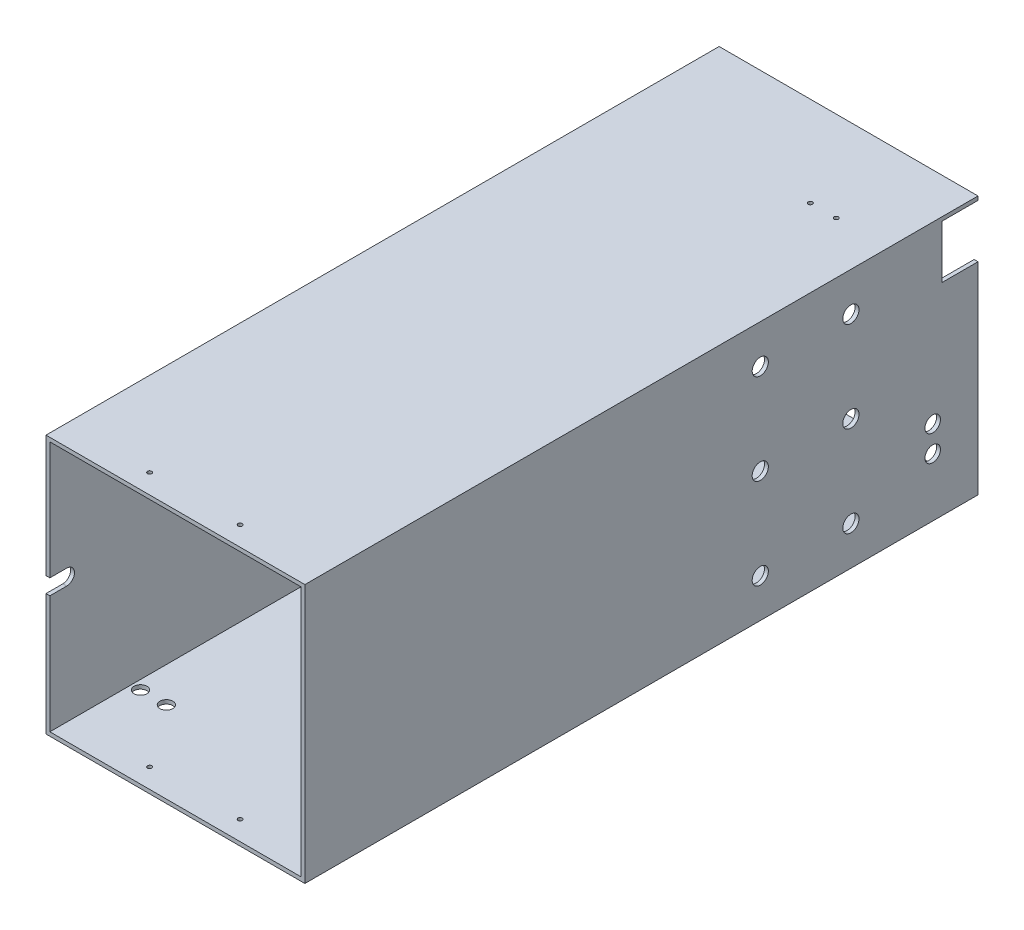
from build123d import *

# Parameters (mm, degrees)
ESQUISSE1_W                     = 200
ESQUISSE1_H                     = 200
ESQUISSE1_W_2                   = 194
ESQUISSE1_H_2                   = 194
EXTRUSION1_DEPTH                = 520
ENL_V_MAT_EXTRU_1_REACH         = 593.946
ESQUISSE2_R                     = 6
ESQUISSE2_R_2                   = 6.25
ESQUISSE2_W                     = 28
ESQUISSE2_H                     = 41
ENL_V_MAT_EXTRU_4_REACH         = 593.946
ESQUISSE7_R                     = 2.5
ENL_V_MAT_EXTRU_5_REACH         = 593.946
ESQUISSE8_R                     = 5
ESQUISSE8_R_2                   = 0.5
ESQUISSE8_W                     = 41
ESQUISSE8_H                     = 28
TROU_TARAUD_M41_D               = 3.3
TROU_TARAUD_M41_DEPTH           = 200
TROU_TARAUD_M41_ON_FACE_2_D     = 3.3
TROU_TARAUD_M41_ON_FACE_2_DEPTH = 200


with BuildPart() as part:
    # Esquisse1 → Extrusion1 (new body)
    with BuildSketch(Plane.XY):
        with Locations((100, 100)):
            Rectangle(ESQUISSE1_W, ESQUISSE1_H)
        with Locations((100, 100)):
            Rectangle(ESQUISSE1_W_2, ESQUISSE1_H_2, mode=Mode.SUBTRACT)
    extrude(amount=EXTRUSION1_DEPTH)

    # Esquisse2 → Enl_v. mat.-Extru.1 (cut, up to next)
    with BuildSketch(Plane(origin=(200, 0, 0), x_dir=(0, 0, -1), z_dir=(1, 0, 0)), mode=Mode.PRIVATE) as enl_v_mat_extru_1_sk1:
        with Locations((-35, 65)):
            Circle(ESQUISSE2_R)
    enl_v_mat_extru_1_tool1 = extrude(enl_v_mat_extru_1_sk1.sketch, amount=-ENL_V_MAT_EXTRU_1_REACH, mode=Mode.PRIVATE) & part.part
    # Esquisse2 → Enl_v. mat.-Extru.1 (cut, up to next)
    with BuildSketch(Plane(origin=(200, 0, 0), x_dir=(0, 0, -1), z_dir=(1, 0, 0)), mode=Mode.PRIVATE) as enl_v_mat_extru_1_sk2:
        with Locations((-35, 45)):
            Circle(ESQUISSE2_R)
    enl_v_mat_extru_1_tool2 = extrude(enl_v_mat_extru_1_sk2.sketch, amount=-ENL_V_MAT_EXTRU_1_REACH, mode=Mode.PRIVATE) & part.part
    # Esquisse2 → Enl_v. mat.-Extru.1 (cut, up to next)
    with BuildSketch(Plane(origin=(200, 0, 0), x_dir=(0, 0, -1), z_dir=(1, 0, 0)), mode=Mode.PRIVATE) as enl_v_mat_extru_1_sk3:
        with Locations((-98.2, 170)):
            Circle(ESQUISSE2_R_2)
    enl_v_mat_extru_1_tool3 = extrude(enl_v_mat_extru_1_sk3.sketch, amount=-ENL_V_MAT_EXTRU_1_REACH, mode=Mode.PRIVATE) & part.part
    # Esquisse2 → Enl_v. mat.-Extru.1 (cut, up to next)
    with BuildSketch(Plane(origin=(200, 0, 0), x_dir=(0, 0, -1), z_dir=(1, 0, 0)), mode=Mode.PRIVATE) as enl_v_mat_extru_1_sk4:
        with Locations((-168.2, 170)):
            Circle(ESQUISSE2_R_2)
    enl_v_mat_extru_1_tool4 = extrude(enl_v_mat_extru_1_sk4.sketch, amount=-ENL_V_MAT_EXTRU_1_REACH, mode=Mode.PRIVATE) & part.part
    # Esquisse2 → Enl_v. mat.-Extru.1 (cut, up to next)
    with BuildSketch(Plane(origin=(200, 0, 0), x_dir=(0, 0, -1), z_dir=(1, 0, 0)), mode=Mode.PRIVATE) as enl_v_mat_extru_1_sk5:
        with Locations((-98.2, 100)):
            Circle(ESQUISSE2_R_2)
    enl_v_mat_extru_1_tool5 = extrude(enl_v_mat_extru_1_sk5.sketch, amount=-ENL_V_MAT_EXTRU_1_REACH, mode=Mode.PRIVATE) & part.part
    # Esquisse2 → Enl_v. mat.-Extru.1 (cut, up to next)
    with BuildSketch(Plane(origin=(200, 0, 0), x_dir=(0, 0, -1), z_dir=(1, 0, 0)), mode=Mode.PRIVATE) as enl_v_mat_extru_1_sk6:
        with Locations((-168.2, 100)):
            Circle(ESQUISSE2_R_2)
    enl_v_mat_extru_1_tool6 = extrude(enl_v_mat_extru_1_sk6.sketch, amount=-ENL_V_MAT_EXTRU_1_REACH, mode=Mode.PRIVATE) & part.part
    # Esquisse2 → Enl_v. mat.-Extru.1 (cut, up to next)
    with BuildSketch(Plane(origin=(200, 0, 0), x_dir=(0, 0, -1), z_dir=(1, 0, 0)), mode=Mode.PRIVATE) as enl_v_mat_extru_1_sk7:
        with Locations((-98.2, 30)):
            Circle(ESQUISSE2_R_2)
    enl_v_mat_extru_1_tool7 = extrude(enl_v_mat_extru_1_sk7.sketch, amount=-ENL_V_MAT_EXTRU_1_REACH, mode=Mode.PRIVATE) & part.part
    # Esquisse2 → Enl_v. mat.-Extru.1 (cut, up to next)
    with BuildSketch(Plane(origin=(200, 0, 0), x_dir=(0, 0, -1), z_dir=(1, 0, 0)), mode=Mode.PRIVATE) as enl_v_mat_extru_1_sk8:
        with Locations((-168.2, 30)):
            Circle(ESQUISSE2_R_2)
    enl_v_mat_extru_1_tool8 = extrude(enl_v_mat_extru_1_sk8.sketch, amount=-ENL_V_MAT_EXTRU_1_REACH, mode=Mode.PRIVATE) & part.part
    # Esquisse2 → Enl_v. mat.-Extru.1 (cut, up to next)
    with BuildSketch(Plane(origin=(200, 0, 0), x_dir=(0, 0, -1), z_dir=(1, 0, 0)), mode=Mode.PRIVATE) as enl_v_mat_extru_1_sk9:
        with Locations((-14, 176.5)):
            Rectangle(ESQUISSE2_W, ESQUISSE2_H)
    enl_v_mat_extru_1_tool9 = extrude(enl_v_mat_extru_1_sk9.sketch, amount=-ENL_V_MAT_EXTRU_1_REACH, mode=Mode.PRIVATE) & part.part
    add(enl_v_mat_extru_1_tool1.solids().sort_by_distance((200, 65, 35))[0], mode=Mode.SUBTRACT)
    add(enl_v_mat_extru_1_tool2.solids().sort_by_distance((200, 45, 35))[0], mode=Mode.SUBTRACT)
    add(enl_v_mat_extru_1_tool3.solids().sort_by_distance((200, 170, 98.2))[0], mode=Mode.SUBTRACT)
    add(enl_v_mat_extru_1_tool4.solids().sort_by_distance((200, 170, 168.2))[0], mode=Mode.SUBTRACT)
    add(enl_v_mat_extru_1_tool5.solids().sort_by_distance((200, 100, 98.2))[0], mode=Mode.SUBTRACT)
    add(enl_v_mat_extru_1_tool6.solids().sort_by_distance((200, 100, 168.2))[0], mode=Mode.SUBTRACT)
    add(enl_v_mat_extru_1_tool7.solids().sort_by_distance((200, 30, 98.2))[0], mode=Mode.SUBTRACT)
    add(enl_v_mat_extru_1_tool8.solids().sort_by_distance((200, 30, 168.2))[0], mode=Mode.SUBTRACT)
    add(enl_v_mat_extru_1_tool9.solids().sort_by_distance((200, 176.5, 14))[0], mode=Mode.SUBTRACT)

    # Esquisse7 → Enl_v. mat.-Extru.4 (cut, up to next)
    with BuildSketch(Plane.ZY, mode=Mode.PRIVATE) as enl_v_mat_extru_4_sk1:
        with Locations((35, 65)):
            Circle(ESQUISSE7_R)
    enl_v_mat_extru_4_tool1 = extrude(enl_v_mat_extru_4_sk1.sketch, amount=-ENL_V_MAT_EXTRU_4_REACH, mode=Mode.PRIVATE) & part.part
    # Esquisse7 → Enl_v. mat.-Extru.4 (cut, up to next)
    with BuildSketch(Plane.ZY, mode=Mode.PRIVATE) as enl_v_mat_extru_4_sk2:
        with BuildLine():
            Line((507, 106), (520, 106))
            Line((520, 106), (520, 94))
            Line((520, 94), (507, 94))
            ThreePointArc((507, 94), (501, 100), (507, 106))
        make_face()
    enl_v_mat_extru_4_tool2 = extrude(enl_v_mat_extru_4_sk2.sketch, amount=-ENL_V_MAT_EXTRU_4_REACH, mode=Mode.PRIVATE) & part.part
    add(enl_v_mat_extru_4_tool1.solids().sort_by_distance((0, 65, 35))[0], mode=Mode.SUBTRACT)
    add(enl_v_mat_extru_4_tool2.solids().sort_by_distance((0, 100, 511.09318))[0], mode=Mode.SUBTRACT)

    # Esquisse8 → Enl_v. mat.-Extru.5 (cut, up to next)
    with BuildSketch(Plane.XZ, mode=Mode.PRIVATE) as enl_v_mat_extru_5_sk1:
        with Locations(Location((10, 457, 0), (0, 0, 270))):
            Circle(ESQUISSE8_R)
    enl_v_mat_extru_5_tool1 = extrude(enl_v_mat_extru_5_sk1.sketch, amount=-ENL_V_MAT_EXTRU_5_REACH, mode=Mode.PRIVATE) & part.part
    # Esquisse8 → Enl_v. mat.-Extru.5 (cut, up to next)
    with BuildSketch(Plane.XZ, mode=Mode.PRIVATE) as enl_v_mat_extru_5_sk2:
        with Locations(Location((30, 73, 0), (0, 0, 270))):
            Circle(ESQUISSE8_R)
    enl_v_mat_extru_5_tool2 = extrude(enl_v_mat_extru_5_sk2.sketch, amount=-ENL_V_MAT_EXTRU_5_REACH, mode=Mode.PRIVATE) & part.part
    # Esquisse8 → Enl_v. mat.-Extru.5 (cut, up to next)
    with BuildSketch(Plane.XZ, mode=Mode.PRIVATE) as enl_v_mat_extru_5_sk3:
        with Locations(Location((10, 73, 0), (0, 0, 270))):
            Circle(ESQUISSE8_R)
    enl_v_mat_extru_5_tool3 = extrude(enl_v_mat_extru_5_sk3.sketch, amount=-ENL_V_MAT_EXTRU_5_REACH, mode=Mode.PRIVATE) & part.part
    # Esquisse8 → Enl_v. mat.-Extru.5 (cut, up to next)
    with BuildSketch(Plane.XZ, mode=Mode.PRIVATE) as enl_v_mat_extru_5_sk4:
        with Locations(Location((65, 505, 0), (0, 0, 270))):
            Circle(ESQUISSE8_R_2)
    enl_v_mat_extru_5_tool4 = extrude(enl_v_mat_extru_5_sk4.sketch, amount=-ENL_V_MAT_EXTRU_5_REACH, mode=Mode.PRIVATE) & part.part
    # Esquisse8 → Enl_v. mat.-Extru.5 (cut, up to next)
    with BuildSketch(Plane.XZ, mode=Mode.PRIVATE) as enl_v_mat_extru_5_sk5:
        with Locations(Location((135, 505, 0), (0, 0, 270))):
            Circle(ESQUISSE8_R_2)
    enl_v_mat_extru_5_tool5 = extrude(enl_v_mat_extru_5_sk5.sketch, amount=-ENL_V_MAT_EXTRU_5_REACH, mode=Mode.PRIVATE) & part.part
    # Esquisse8 → Enl_v. mat.-Extru.5 (cut, up to next)
    with BuildSketch(Plane.XZ, mode=Mode.PRIVATE) as enl_v_mat_extru_5_sk6:
        with Locations(Location((30, 457, 0), (0, 0, 270))):
            Circle(ESQUISSE8_R)
    enl_v_mat_extru_5_tool6 = extrude(enl_v_mat_extru_5_sk6.sketch, amount=-ENL_V_MAT_EXTRU_5_REACH, mode=Mode.PRIVATE) & part.part
    # Esquisse8 → Enl_v. mat.-Extru.5 (cut, up to next)
    with BuildSketch(Plane.XZ, mode=Mode.PRIVATE) as enl_v_mat_extru_5_sk7:
        with Locations(Location((140, 69.5, 0), (0, 0, 270))):
            Circle(ESQUISSE8_R_2)
    enl_v_mat_extru_5_tool7 = extrude(enl_v_mat_extru_5_sk7.sketch, amount=-ENL_V_MAT_EXTRU_5_REACH, mode=Mode.PRIVATE) & part.part
    # Esquisse8 → Enl_v. mat.-Extru.5 (cut, up to next)
    with BuildSketch(Plane.XZ, mode=Mode.PRIVATE) as enl_v_mat_extru_5_sk8:
        with Locations(Location((160, 69.5, 0), (0, 0, 270))):
            Circle(ESQUISSE8_R_2)
    enl_v_mat_extru_5_tool8 = extrude(enl_v_mat_extru_5_sk8.sketch, amount=-ENL_V_MAT_EXTRU_5_REACH, mode=Mode.PRIVATE) & part.part
    # Esquisse8 → Enl_v. mat.-Extru.5 (cut, up to next)
    with BuildSketch(Plane.XZ, mode=Mode.PRIVATE) as enl_v_mat_extru_5_sk9:
        with Locations((23.5, 14)):
            Rectangle(ESQUISSE8_W, ESQUISSE8_H)
    enl_v_mat_extru_5_tool9 = extrude(enl_v_mat_extru_5_sk9.sketch, amount=-ENL_V_MAT_EXTRU_5_REACH, mode=Mode.PRIVATE) & part.part
    add(enl_v_mat_extru_5_tool1.solids().sort_by_distance((10, 0, 457))[0], mode=Mode.SUBTRACT)
    add(enl_v_mat_extru_5_tool2.solids().sort_by_distance((30, 0, 73))[0], mode=Mode.SUBTRACT)
    add(enl_v_mat_extru_5_tool3.solids().sort_by_distance((10, 0, 73))[0], mode=Mode.SUBTRACT)
    add(enl_v_mat_extru_5_tool4.solids().sort_by_distance((65, 0, 505))[0], mode=Mode.SUBTRACT)
    add(enl_v_mat_extru_5_tool5.solids().sort_by_distance((135, 0, 505))[0], mode=Mode.SUBTRACT)
    add(enl_v_mat_extru_5_tool6.solids().sort_by_distance((30, 0, 457))[0], mode=Mode.SUBTRACT)
    add(enl_v_mat_extru_5_tool7.solids().sort_by_distance((140, 0, 69.5))[0], mode=Mode.SUBTRACT)
    add(enl_v_mat_extru_5_tool8.solids().sort_by_distance((160, 0, 69.5))[0], mode=Mode.SUBTRACT)
    add(enl_v_mat_extru_5_tool9.solids().sort_by_distance((23.5, 0, 14))[0], mode=Mode.SUBTRACT)

    # Trou taraud_ M41
    with Locations(Plane(origin=(65, 0, 505), x_dir=(0, 0, -1), z_dir=(0, -1, 0))):
        with Locations((0, 0), (0, 70), (435.5, 75), (435.5, 95)):
            Hole(TROU_TARAUD_M41_D / 2, depth=TROU_TARAUD_M41_DEPTH)

    # Trou taraud_ M41 on face 2
    with Locations(Plane(origin=(65, 200, 505), x_dir=(0, 0, 1), z_dir=(0, 1, 0))):
        with Locations((0, 0), (0, 70)):
            Hole(TROU_TARAUD_M41_ON_FACE_2_D / 2, depth=TROU_TARAUD_M41_ON_FACE_2_DEPTH)


solid = part.part
